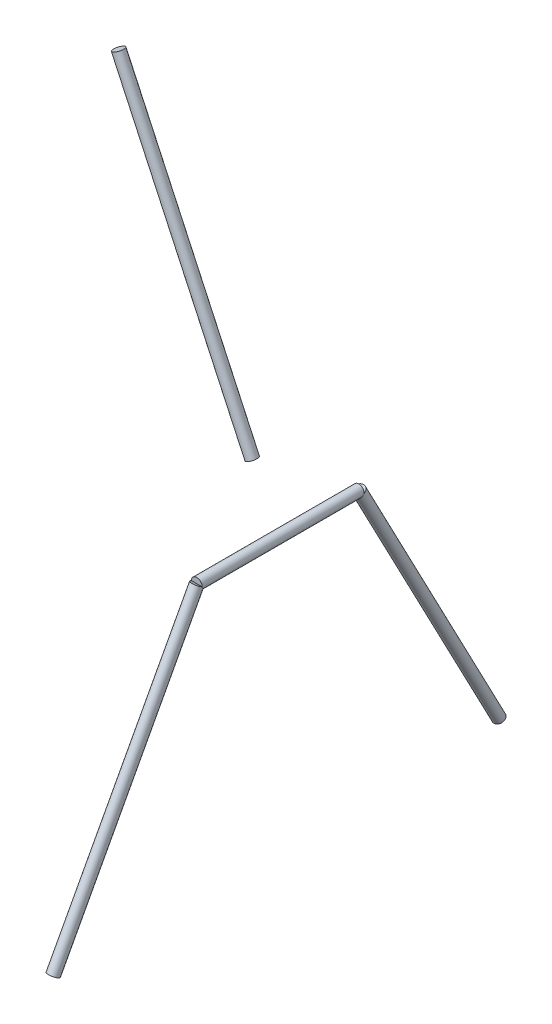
from build123d import *

# Parameters (mm, degrees)
CABLE_PUENTE_1_PROFILE_R = 0.8
CABLE_PUENTE_2_PROFILE_R = 0.8
CABLE_PUENTE_3_PROFILE_R = 0.8
CABLE_TIRO_PROFILE_R     = 0.8


with BuildPart() as part:
    # Cable_puente_1: sweep along a curve in space
    with BuildLine() as cable_puente_1_path:
        Line((424.610876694, 411.579118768, -33), (424.876296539, 451.390292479, -12))
    # Cable_puente_1 profile (on start of the path) → Cable_puente_1 (sweep)
    with BuildSketch(Plane(origin=(424.610876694, 411.579118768, -33), x_dir=(0, -0.4665595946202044, 0.8844897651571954), z_dir=(0.005896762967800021, 0.8844743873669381, 0.46655148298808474))):
        Circle(CABLE_PUENTE_1_PROFILE_R)
    sweep(path=cable_puente_1_path.line)

    # Cable_puente_2: sweep along a curve in space
    with BuildLine() as cable_puente_2_path:
        Line((424.876296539, 451.390292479, -12), (424.876296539, 451.390292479, 12))
    # Cable_puente_2 profile (on start of the path) → Cable_puente_2 (sweep)
    with BuildSketch(Plane(origin=(424.876296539, 451.390292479, -12), x_dir=(1, 0, 0), z_dir=(0, 0, 1))):
        Circle(CABLE_PUENTE_2_PROFILE_R)
    sweep(path=cable_puente_2_path.line)

    # Cable_puente_3: sweep along a curve in space
    with BuildLine() as cable_puente_3_path:
        Line((424.876296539, 451.390292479, 12), (424.610876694, 411.579118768, 33))
    # Cable_puente_3 profile (on start of the path) → Cable_puente_3 (sweep)
    with BuildSketch(Plane(origin=(424.876296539, 451.390292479, 12), x_dir=(0, -0.4665595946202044, -0.8844897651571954), z_dir=(-0.005896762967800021, -0.8844743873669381, 0.46655148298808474))):
        Circle(CABLE_PUENTE_3_PROFILE_R)
    sweep(path=cable_puente_3_path.line)


with BuildPart() as body_2:
    # Cable_tiro: sweep along a curve in space
    with BuildLine() as cable_tiro_path:
        Line((421.087581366, 459.553970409, 0), (401.3020688, 502.18651071, 0))
    # Cable_tiro profile (on start of the path) → Cable_tiro (sweep)
    with BuildSketch(Plane(origin=(421.087581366, 459.553970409, 0), x_dir=(0.9070753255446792, 0.42096835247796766, 0), z_dir=(-0.42096835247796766, 0.9070753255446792, 0))):
        Circle(CABLE_TIRO_PROFILE_R)
    sweep(path=cable_tiro_path.line)


solid = Compound([part.part, body_2.part])
